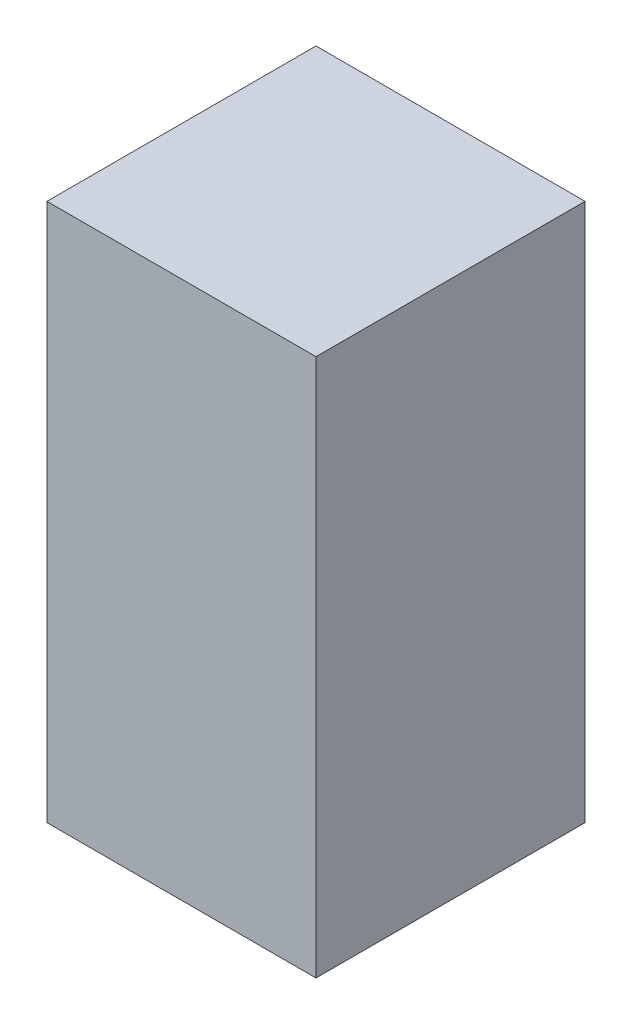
ISO-10303-21;
HEADER;
FILE_DESCRIPTION(('STEP AP214'),'2;1');
FILE_NAME('part.step','',(''),(''),'','','');
FILE_SCHEMA(('AUTOMOTIVE_DESIGN { 1 0 10303 214 1 1 1 1 }'));
ENDSEC;
DATA;
#1=APPLICATION_CONTEXT('core data for automotive mechanical design processes');
#2=APPLICATION_PROTOCOL_DEFINITION('international standard','automotive_design',2000,#1);
#3=PRODUCT_CONTEXT('',#1,'mechanical');
#4=PRODUCT('Part','Part','',(#3));
#5=PRODUCT_RELATED_PRODUCT_CATEGORY('part','',(#4));
#6=PRODUCT_DEFINITION_FORMATION('','',#4);
#7=PRODUCT_DEFINITION_CONTEXT('part definition',#1,'design');
#8=PRODUCT_DEFINITION('design','',#6,#7);
#9=PRODUCT_DEFINITION_SHAPE('','',#8);
#10=(LENGTH_UNIT() NAMED_UNIT(*) SI_UNIT(.MILLI.,.METRE.));
#11=(NAMED_UNIT(*) PLANE_ANGLE_UNIT() SI_UNIT($,.RADIAN.));
#12=(NAMED_UNIT(*) SI_UNIT($,.STERADIAN.) SOLID_ANGLE_UNIT());
#13=UNCERTAINTY_MEASURE_WITH_UNIT(LENGTH_MEASURE(1.E-05),#10,'distance_accuracy_value','');
#14=(GEOMETRIC_REPRESENTATION_CONTEXT(3) GLOBAL_UNCERTAINTY_ASSIGNED_CONTEXT((#13)) GLOBAL_UNIT_ASSIGNED_CONTEXT((#10,
#11,#12)) REPRESENTATION_CONTEXT('',''));
#15=CARTESIAN_POINT('',(0.,0.,0.));
#16=DIRECTION('',(0.,0.,1.));
#17=DIRECTION('',(1.,0.,0.));
#18=AXIS2_PLACEMENT_3D('',#15,#16,#17);
#19=CARTESIAN_POINT('',(25.4,101.6,-25.4));
#20=DIRECTION('',(-1.,0.,0.));
#21=DIRECTION('',(0.,0.,1.));
#22=AXIS2_PLACEMENT_3D('',#19,#20,#21);
#23=PLANE('',#22);
#24=DIRECTION('',(0.,0.,-1.));
#25=VECTOR('',#24,1.);
#26=CARTESIAN_POINT('',(25.4,0.,-25.4));
#27=LINE('',#26,#25);
#28=CARTESIAN_POINT('',(25.4,0.,25.4));
#29=VERTEX_POINT('',#28);
#30=CARTESIAN_POINT('',(25.4,0.,-25.4));
#31=VERTEX_POINT('',#30);
#32=EDGE_CURVE('E95',#29,#31,#27,.T.);
#33=ORIENTED_EDGE('',*,*,#32,.T.);
#34=DIRECTION('',(0.,-1.,0.));
#35=VECTOR('',#34,1.);
#36=CARTESIAN_POINT('',(25.4,101.6,-25.4));
#37=LINE('',#36,#35);
#38=CARTESIAN_POINT('',(25.4,101.6,-25.4));
#39=VERTEX_POINT('',#38);
#40=EDGE_CURVE('E11',#39,#31,#37,.T.);
#41=ORIENTED_EDGE('',*,*,#40,.F.);
#42=DIRECTION('',(0.,0.,-1.));
#43=VECTOR('',#42,1.);
#44=CARTESIAN_POINT('',(25.4,101.6,-25.4));
#45=LINE('',#44,#43);
#46=CARTESIAN_POINT('',(25.4,101.6,25.4));
#47=VERTEX_POINT('',#46);
#48=EDGE_CURVE('E83',#47,#39,#45,.T.);
#49=ORIENTED_EDGE('',*,*,#48,.F.);
#50=DIRECTION('',(0.,-1.,0.));
#51=VECTOR('',#50,1.);
#52=CARTESIAN_POINT('',(25.4,101.6,25.4));
#53=LINE('',#52,#51);
#54=EDGE_CURVE('E91',#47,#29,#53,.T.);
#55=ORIENTED_EDGE('',*,*,#54,.T.);
#56=EDGE_LOOP('',(#33,#41,#49,#55));
#57=FACE_BOUND('',#56,.T.);
#58=ADVANCED_FACE('F32',(#57),#23,.F.);
#59=CARTESIAN_POINT('',(-25.4,101.6,-25.4));
#60=DIRECTION('',(0.,0.,1.));
#61=DIRECTION('',(1.,0.,0.));
#62=AXIS2_PLACEMENT_3D('',#59,#60,#61);
#63=PLANE('',#62);
#64=DIRECTION('',(-1.,0.,0.));
#65=VECTOR('',#64,1.);
#66=CARTESIAN_POINT('',(-25.4,0.,-25.4));
#67=LINE('',#66,#65);
#68=CARTESIAN_POINT('',(-25.4,0.,-25.4));
#69=VERTEX_POINT('',#68);
#70=EDGE_CURVE('E87',#31,#69,#67,.T.);
#71=ORIENTED_EDGE('',*,*,#70,.T.);
#72=DIRECTION('',(0.,-1.,0.));
#73=VECTOR('',#72,1.);
#74=CARTESIAN_POINT('',(-25.4,101.6,-25.4));
#75=LINE('',#74,#73);
#76=CARTESIAN_POINT('',(-25.4,101.6,-25.4));
#77=VERTEX_POINT('',#76);
#78=EDGE_CURVE('E40',#77,#69,#75,.T.);
#79=ORIENTED_EDGE('',*,*,#78,.F.);
#80=DIRECTION('',(-1.,0.,0.));
#81=VECTOR('',#80,1.);
#82=CARTESIAN_POINT('',(-25.4,101.6,-25.4));
#83=LINE('',#82,#81);
#84=EDGE_CURVE('E78',#39,#77,#83,.T.);
#85=ORIENTED_EDGE('',*,*,#84,.F.);
#86=ORIENTED_EDGE('',*,*,#40,.T.);
#87=EDGE_LOOP('',(#71,#79,#85,#86));
#88=FACE_BOUND('',#87,.T.);
#89=ADVANCED_FACE('F86',(#88),#63,.F.);
#90=CARTESIAN_POINT('',(-25.4,101.6,-25.4));
#91=DIRECTION('',(1.,0.,0.));
#92=DIRECTION('',(0.,0.,-1.));
#93=AXIS2_PLACEMENT_3D('',#90,#91,#92);
#94=PLANE('',#93);
#95=DIRECTION('',(0.,0.,1.));
#96=VECTOR('',#95,1.);
#97=CARTESIAN_POINT('',(-25.4,0.,-25.4));
#98=LINE('',#97,#96);
#99=CARTESIAN_POINT('',(-25.4,0.,25.4));
#100=VERTEX_POINT('',#99);
#101=EDGE_CURVE('E65',#69,#100,#98,.T.);
#102=ORIENTED_EDGE('',*,*,#101,.T.);
#103=DIRECTION('',(0.,-1.,0.));
#104=VECTOR('',#103,1.);
#105=CARTESIAN_POINT('',(-25.4,101.6,25.4));
#106=LINE('',#105,#104);
#107=CARTESIAN_POINT('',(-25.4,101.6,25.4));
#108=VERTEX_POINT('',#107);
#109=EDGE_CURVE('E88',#108,#100,#106,.T.);
#110=ORIENTED_EDGE('',*,*,#109,.F.);
#111=DIRECTION('',(0.,0.,1.));
#112=VECTOR('',#111,1.);
#113=CARTESIAN_POINT('',(-25.4,101.6,-25.4));
#114=LINE('',#113,#112);
#115=EDGE_CURVE('E81',#77,#108,#114,.T.);
#116=ORIENTED_EDGE('',*,*,#115,.F.);
#117=ORIENTED_EDGE('',*,*,#78,.T.);
#118=EDGE_LOOP('',(#102,#110,#116,#117));
#119=FACE_BOUND('',#118,.T.);
#120=ADVANCED_FACE('F89',(#119),#94,.F.);
#121=CARTESIAN_POINT('',(-25.4,101.6,25.4));
#122=DIRECTION('',(0.,0.,-1.));
#123=DIRECTION('',(-1.,0.,0.));
#124=AXIS2_PLACEMENT_3D('',#121,#122,#123);
#125=PLANE('',#124);
#126=DIRECTION('',(1.,0.,0.));
#127=VECTOR('',#126,1.);
#128=CARTESIAN_POINT('',(-25.4,0.,25.4));
#129=LINE('',#128,#127);
#130=EDGE_CURVE('E71',#100,#29,#129,.T.);
#131=ORIENTED_EDGE('',*,*,#130,.T.);
#132=ORIENTED_EDGE('',*,*,#54,.F.);
#133=DIRECTION('',(1.,0.,0.));
#134=VECTOR('',#133,1.);
#135=CARTESIAN_POINT('',(-25.4,101.6,25.4));
#136=LINE('',#135,#134);
#137=EDGE_CURVE('E48',#108,#47,#136,.T.);
#138=ORIENTED_EDGE('',*,*,#137,.F.);
#139=ORIENTED_EDGE('',*,*,#109,.T.);
#140=EDGE_LOOP('',(#131,#132,#138,#139));
#141=FACE_BOUND('',#140,.T.);
#142=ADVANCED_FACE('F102',(#141),#125,.F.);
#143=CARTESIAN_POINT('',(0.,101.6,0.));
#144=DIRECTION('',(0.,1.,0.));
#145=DIRECTION('',(0.,0.,1.));
#146=AXIS2_PLACEMENT_3D('',#143,#144,#145);
#147=PLANE('',#146);
#148=ORIENTED_EDGE('',*,*,#48,.T.);
#149=ORIENTED_EDGE('',*,*,#84,.T.);
#150=ORIENTED_EDGE('',*,*,#115,.T.);
#151=ORIENTED_EDGE('',*,*,#137,.T.);
#152=EDGE_LOOP('',(#148,#149,#150,#151));
#153=FACE_BOUND('',#152,.T.);
#154=ADVANCED_FACE('F79',(#153),#147,.T.);
#155=CARTESIAN_POINT('',(0.,0.,0.));
#156=DIRECTION('',(0.,1.,0.));
#157=DIRECTION('',(0.,0.,1.));
#158=AXIS2_PLACEMENT_3D('',#155,#156,#157);
#159=PLANE('',#158);
#160=ORIENTED_EDGE('',*,*,#32,.F.);
#161=ORIENTED_EDGE('',*,*,#130,.F.);
#162=ORIENTED_EDGE('',*,*,#101,.F.);
#163=ORIENTED_EDGE('',*,*,#70,.F.);
#164=EDGE_LOOP('',(#160,#161,#162,#163));
#165=FACE_BOUND('',#164,.T.);
#166=ADVANCED_FACE('F105',(#165),#159,.F.);
#167=CLOSED_SHELL('',(#58,#89,#120,#142,#154,#166));
#168=MANIFOLD_SOLID_BREP('B2',#167);
#169=ADVANCED_BREP_SHAPE_REPRESENTATION('',(#18,#168),#14);
#170=SHAPE_DEFINITION_REPRESENTATION(#9,#169);
ENDSEC;
END-ISO-10303-21;
